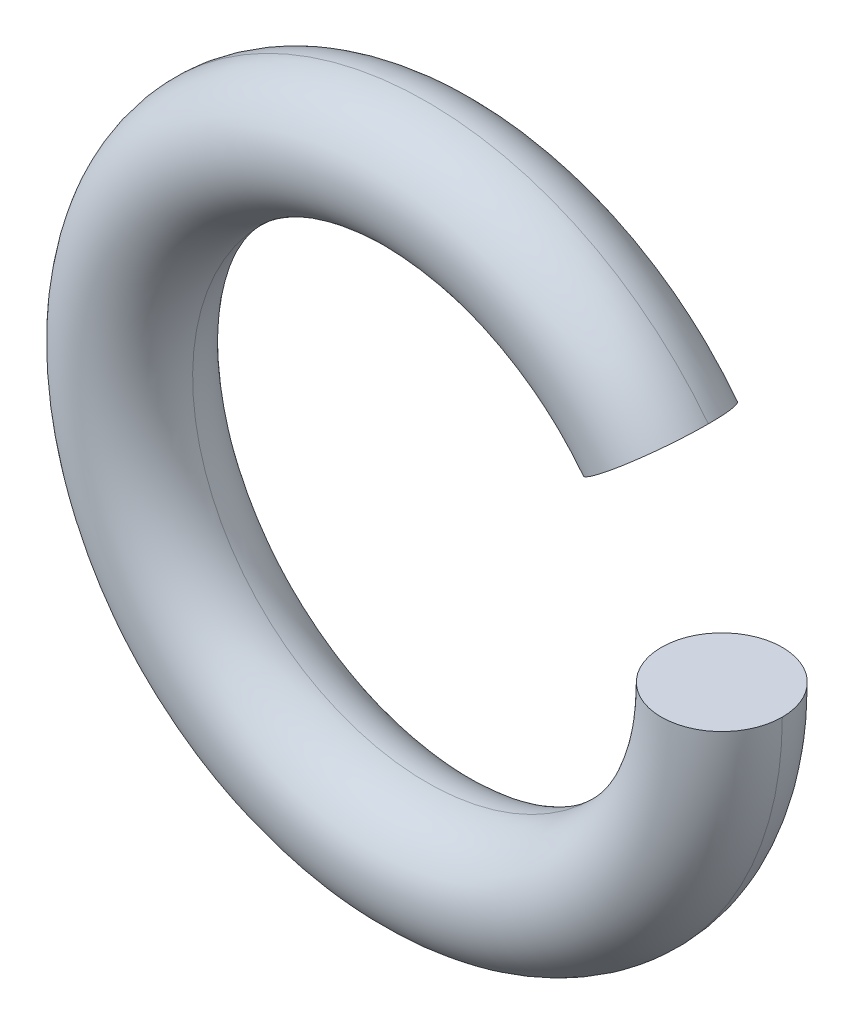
ISO-10303-21;
HEADER;
FILE_DESCRIPTION(('STEP AP214'),'2;1');
FILE_NAME('part.step','',(''),(''),'','','');
FILE_SCHEMA(('AUTOMOTIVE_DESIGN { 1 0 10303 214 1 1 1 1 }'));
ENDSEC;
DATA;
#1=APPLICATION_CONTEXT('core data for automotive mechanical design processes');
#2=APPLICATION_PROTOCOL_DEFINITION('international standard','automotive_design',2000,#1);
#3=PRODUCT_CONTEXT('',#1,'mechanical');
#4=PRODUCT('Part','Part','',(#3));
#5=PRODUCT_RELATED_PRODUCT_CATEGORY('part','',(#4));
#6=PRODUCT_DEFINITION_FORMATION('','',#4);
#7=PRODUCT_DEFINITION_CONTEXT('part definition',#1,'design');
#8=PRODUCT_DEFINITION('design','',#6,#7);
#9=PRODUCT_DEFINITION_SHAPE('','',#8);
#10=(LENGTH_UNIT() NAMED_UNIT(*) SI_UNIT(.MILLI.,.METRE.));
#11=(NAMED_UNIT(*) PLANE_ANGLE_UNIT() SI_UNIT($,.RADIAN.));
#12=(NAMED_UNIT(*) SI_UNIT($,.STERADIAN.) SOLID_ANGLE_UNIT());
#13=UNCERTAINTY_MEASURE_WITH_UNIT(LENGTH_MEASURE(1.E-05),#10,'distance_accuracy_value','');
#14=(GEOMETRIC_REPRESENTATION_CONTEXT(3) GLOBAL_UNCERTAINTY_ASSIGNED_CONTEXT((#13)) GLOBAL_UNIT_ASSIGNED_CONTEXT((#10,
#11,#12)) REPRESENTATION_CONTEXT('',''));
#15=CARTESIAN_POINT('',(0.,0.,0.));
#16=DIRECTION('',(0.,0.,1.));
#17=DIRECTION('',(1.,0.,0.));
#18=AXIS2_PLACEMENT_3D('',#15,#16,#17);
#19=CARTESIAN_POINT('',(0.,0.,0.));
#20=DIRECTION('',(0.,0.,1.));
#21=DIRECTION('',(1.,0.,0.));
#22=AXIS2_PLACEMENT_3D('',#19,#20,#21);
#23=TOROIDAL_SURFACE('',#22,1.95,0.4);
#24=CARTESIAN_POINT('',(1.54417273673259,1.19081088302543,0.));
#25=DIRECTION('',(-0.610672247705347,0.791883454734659,0.));
#26=DIRECTION('',(0.,0.,1.));
#27=AXIS2_PLACEMENT_3D('',#24,#25,#26);
#28=CIRCLE('',#27,0.4);
#29=CARTESIAN_POINT('',(1.86092611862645,1.43507978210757,0.));
#30=VERTEX_POINT('',#29);
#31=CARTESIAN_POINT('',(1.22741935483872,0.946541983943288,0.));
#32=VERTEX_POINT('',#31);
#33=EDGE_CURVE('E68',#30,#32,#28,.T.);
#34=ORIENTED_EDGE('',*,*,#33,.T.);
#35=CARTESIAN_POINT('',(0.,0.,0.));
#36=DIRECTION('',(0.,0.,1.));
#37=DIRECTION('',(-1.,0.,0.));
#38=AXIS2_PLACEMENT_3D('',#35,#36,#37);
#39=CIRCLE('',#38,1.55);
#40=CARTESIAN_POINT('',(1.55,0.,0.));
#41=VERTEX_POINT('',#40);
#42=EDGE_CURVE('E12',#32,#41,#39,.T.);
#43=ORIENTED_EDGE('',*,*,#42,.T.);
#44=CARTESIAN_POINT('',(1.95,0.,0.));
#45=DIRECTION('',(0.,1.,0.));
#46=DIRECTION('',(0.,0.,1.));
#47=AXIS2_PLACEMENT_3D('',#44,#45,#46);
#48=CIRCLE('',#47,0.4);
#49=CARTESIAN_POINT('',(2.35,0.,0.));
#50=VERTEX_POINT('',#49);
#51=EDGE_CURVE('E69',#50,#41,#48,.T.);
#52=ORIENTED_EDGE('',*,*,#51,.F.);
#53=CARTESIAN_POINT('',(0.,0.,0.));
#54=DIRECTION('',(0.,0.,-1.));
#55=DIRECTION('',(1.,0.,0.));
#56=AXIS2_PLACEMENT_3D('',#53,#54,#55);
#57=CIRCLE('',#56,2.35);
#58=EDGE_CURVE('E48',#50,#30,#57,.T.);
#59=ORIENTED_EDGE('',*,*,#58,.T.);
#60=EDGE_LOOP('',(#34,#43,#52,#59));
#61=FACE_BOUND('',#60,.T.);
#62=ADVANCED_FACE('F40',(#61),#23,.T.);
#63=ORIENTED_EDGE('',*,*,#42,.F.);
#64=EDGE_CURVE('E64',#32,#30,#28,.T.);
#65=ORIENTED_EDGE('',*,*,#64,.T.);
#66=ORIENTED_EDGE('',*,*,#58,.F.);
#67=EDGE_CURVE('E74',#41,#50,#48,.T.);
#68=ORIENTED_EDGE('',*,*,#67,.F.);
#69=EDGE_LOOP('',(#63,#65,#66,#68));
#70=FACE_BOUND('',#69,.T.);
#71=ADVANCED_FACE('F42',(#70),#23,.T.);
#72=CARTESIAN_POINT('',(1.54417273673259,1.19081088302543,0.));
#73=DIRECTION('',(-0.610672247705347,0.791883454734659,0.));
#74=DIRECTION('',(0.,0.,1.));
#75=AXIS2_PLACEMENT_3D('',#72,#73,#74);
#76=PLANE('',#75);
#77=ORIENTED_EDGE('',*,*,#33,.F.);
#78=ORIENTED_EDGE('',*,*,#64,.F.);
#79=EDGE_LOOP('',(#77,#78));
#80=FACE_BOUND('',#79,.T.);
#81=ADVANCED_FACE('F72',(#80),#76,.F.);
#82=CARTESIAN_POINT('',(1.95,0.,0.));
#83=DIRECTION('',(0.,1.,0.));
#84=DIRECTION('',(0.,0.,1.));
#85=AXIS2_PLACEMENT_3D('',#82,#83,#84);
#86=PLANE('',#85);
#87=ORIENTED_EDGE('',*,*,#51,.T.);
#88=ORIENTED_EDGE('',*,*,#67,.T.);
#89=EDGE_LOOP('',(#87,#88));
#90=FACE_BOUND('',#89,.T.);
#91=ADVANCED_FACE('F76',(#90),#86,.T.);
#92=CLOSED_SHELL('',(#62,#71,#81,#91));
#93=MANIFOLD_SOLID_BREP('B2',#92);
#94=ADVANCED_BREP_SHAPE_REPRESENTATION('',(#18,#93),#14);
#95=SHAPE_DEFINITION_REPRESENTATION(#9,#94);
ENDSEC;
END-ISO-10303-21;
